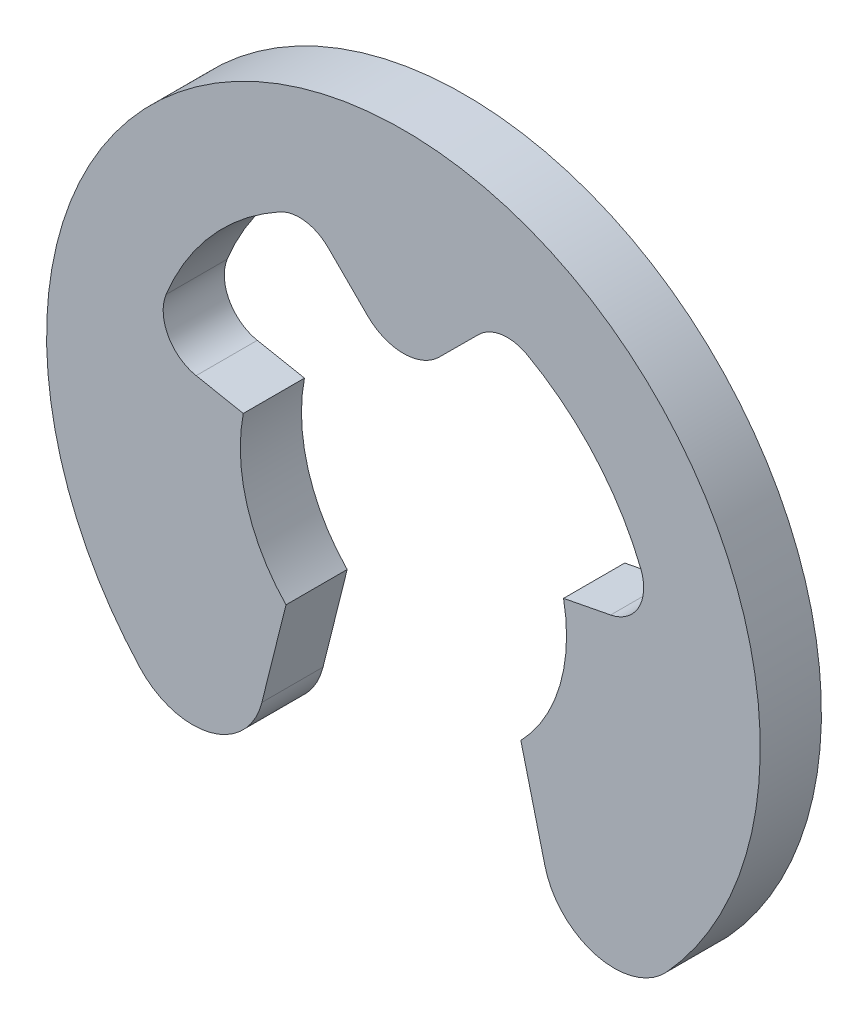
from build123d import *

# Parameters (mm, degrees)
BOSS_EXTRU_1_DEPTH = 0.6


with BuildPart() as part:
    # Esquisse1 → Boss.-Extru.1 (new body)
    with BuildSketch(Plane.XY):
        with BuildLine():
            Line((-0.351702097, 1.745307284), (-0.737506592, 2.129718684))
            ThreePointArc((-0.737506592, 2.129718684), (-0.964229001, 2.242480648), (-1.213235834, 2.196503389))
            ThreePointArc((-1.213235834, 2.196503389), (-1.878959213, 1.663153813), (-2.327544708, 0.937605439))
            ThreePointArc((-2.327544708, 0.937605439), (-2.307961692, 0.597129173), (-2.032905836, 0.395506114))
            Line((-2.032905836, 0.395506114), (-1.570552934, 0.305554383))
            ThreePointArc((-1.570552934, 0.305554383), (-1.534297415, -0.453796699), (-1.151669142, -1.110701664))
            Line((-1.151669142, -1.110701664), (-1.388279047, -2.057968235))
            ThreePointArc((-1.388279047, -2.057968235), (-1.895796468, -2.566969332), (-2.584267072, -2.360416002))
            ThreePointArc((-2.584267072, -2.360416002), (0, 3.5), (2.584267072, -2.360416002))
            ThreePointArc((2.584267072, -2.360416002), (1.895796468, -2.566969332), (1.388279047, -2.057968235))
            Line((1.388279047, -2.057968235), (1.151669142, -1.110701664))
            ThreePointArc((1.151669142, -1.110701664), (1.534297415, -0.453796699), (1.570552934, 0.305554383))
            Line((1.570552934, 0.305554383), (2.032905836, 0.395506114))
            ThreePointArc((2.032905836, 0.395506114), (2.307961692, 0.597129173), (2.327544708, 0.937605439))
            ThreePointArc((2.327544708, 0.937605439), (1.878959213, 1.663153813), (1.213235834, 2.196503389))
            ThreePointArc((1.213235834, 2.196503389), (0.964229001, 2.242480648), (0.737506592, 2.129718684))
            Line((0.737506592, 2.129718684), (0.351702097, 1.745307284))
            ThreePointArc((0.351702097, 1.745307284), (0, 1.6), (-0.351702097, 1.745307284))
        make_face()
    extrude(amount=BOSS_EXTRU_1_DEPTH)


solid = part.part
